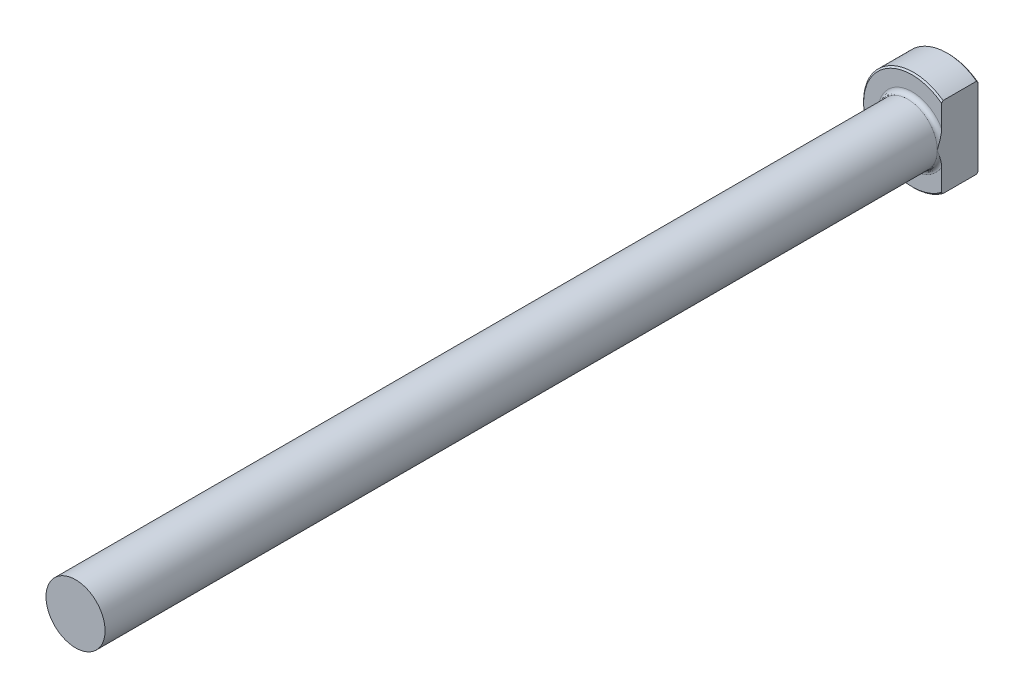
from build123d import *

# Parameters (mm, degrees)
CHAMFER1_SIZE      = 0.254
CUT_EXTRUDE1_REACH = 154.899


with BuildPart() as part:
    # Sketch1 → Revolve1 (revolve)
    with BuildSketch(Plane(origin=(0, 0, 0), x_dir=(0, 0, -1), z_dir=(1, 0, 0)), mode=Mode.PRIVATE) as revolve1_sk:
        with BuildLine():
            Line((0, 0), (0, 8.7249))
            Line((0, 8.7249), (-6.35, 8.7249))
            Line((-6.35, 8.7249), (-6.35, 5.92074))
            ThreePointArc((-6.35, 5.92074), (-6.573184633, 5.381924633), (-7.112, 5.15874))
            Line((-7.112, 5.15874), (-152.4, 5.15874))
            Line((-152.4, 5.15874), (-152.4, 0))
            Line((-152.4, 0), (0, 0))
        make_face()
    revolve(revolve1_sk.sketch.rotate(Axis((0, 0, -25.434744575), (0, 0, 1)), 90), axis=Axis((0, 0, -25.434744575), (0, 0, 1)))

    # Chamfer1
    chamfer1_edges = [part.edges().sort_by_distance(p)[0] for p in [
        (8.7249, 0, 0),
        (8.7249, 0, 6.35),
    ]]
    chamfer(chamfer1_edges, length=CHAMFER1_SIZE)

    # Sketch2 → Cut-Extrude1 (cut, up to next)
    with BuildSketch(Plane(origin=(0, 0, 0), x_dir=(-1, 0, 0), z_dir=(0, 0, -1)), mode=Mode.PRIVATE) as cut_extrude1_sk1:
        with BuildLine():
            Line((-5.15874, 7.036425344), (-5.15874, -7.036425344))
            ThreePointArc((-5.15874, -7.036425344), (-8.7249, 0), (-5.15874, 7.036425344))
        make_face()
    cut_extrude1_tool1 = extrude(cut_extrude1_sk1.sketch, amount=-CUT_EXTRUDE1_REACH, mode=Mode.PRIVATE) & part.part
    add(cut_extrude1_tool1.solids().sort_by_distance((6.613576, 0, 0))[0], mode=Mode.SUBTRACT)


solid = part.part
